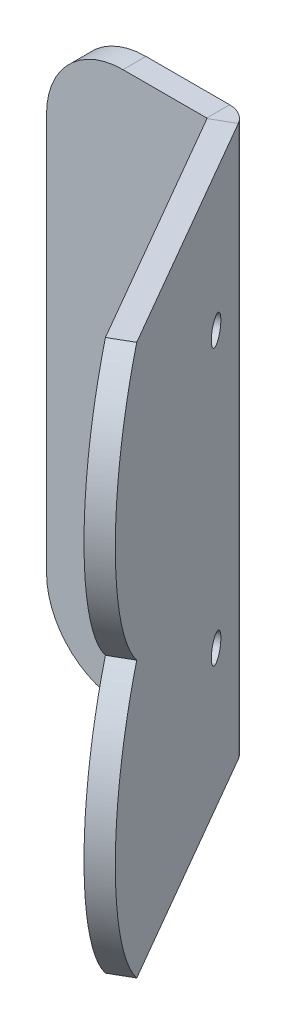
ISO-10303-21;
HEADER;
FILE_DESCRIPTION(('STEP AP214'),'2;1');
FILE_NAME('part.step','',(''),(''),'','','');
FILE_SCHEMA(('AUTOMOTIVE_DESIGN { 1 0 10303 214 1 1 1 1 }'));
ENDSEC;
DATA;
#1=APPLICATION_CONTEXT('core data for automotive mechanical design processes');
#2=APPLICATION_PROTOCOL_DEFINITION('international standard','automotive_design',2000,#1);
#3=PRODUCT_CONTEXT('',#1,'mechanical');
#4=PRODUCT('Part','Part','',(#3));
#5=PRODUCT_RELATED_PRODUCT_CATEGORY('part','',(#4));
#6=PRODUCT_DEFINITION_FORMATION('','',#4);
#7=PRODUCT_DEFINITION_CONTEXT('part definition',#1,'design');
#8=PRODUCT_DEFINITION('design','',#6,#7);
#9=PRODUCT_DEFINITION_SHAPE('','',#8);
#10=(LENGTH_UNIT() NAMED_UNIT(*) SI_UNIT(.MILLI.,.METRE.));
#11=(NAMED_UNIT(*) PLANE_ANGLE_UNIT() SI_UNIT($,.RADIAN.));
#12=(NAMED_UNIT(*) SI_UNIT($,.STERADIAN.) SOLID_ANGLE_UNIT());
#13=UNCERTAINTY_MEASURE_WITH_UNIT(LENGTH_MEASURE(1.E-05),#10,'distance_accuracy_value','');
#14=(GEOMETRIC_REPRESENTATION_CONTEXT(3) GLOBAL_UNCERTAINTY_ASSIGNED_CONTEXT((#13)) GLOBAL_UNIT_ASSIGNED_CONTEXT((#10,
#11,#12)) REPRESENTATION_CONTEXT('',''));
#15=CARTESIAN_POINT('',(0.,0.,0.));
#16=DIRECTION('',(0.,0.,1.));
#17=DIRECTION('',(1.,0.,0.));
#18=AXIS2_PLACEMENT_3D('',#15,#16,#17);
#19=CARTESIAN_POINT('',(33.1061153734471,18.,17.9591240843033));
#20=DIRECTION('',(-0.86602540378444,0.,0.499999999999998));
#21=DIRECTION('',(0.499999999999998,0.,0.86602540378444));
#22=AXIS2_PLACEMENT_3D('',#19,#20,#21);
#23=PLANE('',#22);
#24=CARTESIAN_POINT('',(27.6061153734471,18.,8.43284464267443));
#25=DIRECTION('',(-0.86602540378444,0.,0.499999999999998));
#26=DIRECTION('',(0.499999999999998,0.,0.86602540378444));
#27=AXIS2_PLACEMENT_3D('',#24,#25,#26);
#28=CIRCLE('',#27,1.7);
#29=CARTESIAN_POINT('',(28.4561153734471,18.,9.90508782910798));
#30=VERTEX_POINT('',#29);
#31=EDGE_CURVE('E221',#30,#30,#28,.T.);
#32=ORIENTED_EDGE('',*,*,#31,.T.);
#33=EDGE_LOOP('',(#32));
#34=FACE_BOUND('',#33,.T.);
#35=CARTESIAN_POINT('',(27.6061153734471,54.,8.43284464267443));
#36=DIRECTION('',(-0.86602540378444,0.,0.499999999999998));
#37=DIRECTION('',(0.499999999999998,0.,0.86602540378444));
#38=AXIS2_PLACEMENT_3D('',#35,#36,#37);
#39=CIRCLE('',#38,1.7);
#40=CARTESIAN_POINT('',(28.4561153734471,54.,9.90508782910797));
#41=VERTEX_POINT('',#40);
#42=EDGE_CURVE('E212',#41,#41,#39,.T.);
#43=ORIENTED_EDGE('',*,*,#42,.T.);
#44=EDGE_LOOP('',(#43));
#45=FACE_BOUND('',#44,.T.);
#46=DIRECTION('',(0.499999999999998,0.,0.86602540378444));
#47=VECTOR('',#46,1.);
#48=CARTESIAN_POINT('',(18.1061153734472,0.,-8.02163802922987));
#49=LINE('',#48,#47);
#50=CARTESIAN_POINT('',(23.6323031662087,0.,1.55));
#51=VERTEX_POINT('',#50);
#52=CARTESIAN_POINT('',(41.7807911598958,0.,32.98410328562));
#53=VERTEX_POINT('',#52);
#54=EDGE_CURVE('E64',#51,#53,#49,.T.);
#55=ORIENTED_EDGE('',*,*,#54,.F.);
#56=DIRECTION('',(0.,1.,0.));
#57=VECTOR('',#56,1.);
#58=CARTESIAN_POINT('',(23.6323031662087,18.,1.55));
#59=LINE('',#58,#57);
#60=CARTESIAN_POINT('',(23.6323031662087,72.,1.55000000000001));
#61=VERTEX_POINT('',#60);
#62=EDGE_CURVE('E56',#51,#61,#59,.T.);
#63=ORIENTED_EDGE('',*,*,#62,.T.);
#64=DIRECTION('',(-0.499999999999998,0.,-0.86602540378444));
#65=VECTOR('',#64,1.);
#66=CARTESIAN_POINT('',(18.1061153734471,72.,-8.02163802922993));
#67=LINE('',#66,#65);
#68=CARTESIAN_POINT('',(41.7807911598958,72.,32.98410328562));
#69=VERTEX_POINT('',#68);
#70=EDGE_CURVE('E71',#69,#61,#67,.T.);
#71=ORIENTED_EDGE('',*,*,#70,.F.);
#72=CARTESIAN_POINT('',(33.1061153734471,54.,17.9591240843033));
#73=DIRECTION('',(-0.86602540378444,0.,0.499999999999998));
#74=DIRECTION('',(0.499999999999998,0.,0.86602540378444));
#75=AXIS2_PLACEMENT_3D('',#72,#73,#74);
#76=CIRCLE('',#75,25.);
#77=CARTESIAN_POINT('',(41.7807911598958,36.,32.98410328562));
#78=VERTEX_POINT('',#77);
#79=EDGE_CURVE('E233',#78,#69,#76,.T.);
#80=ORIENTED_EDGE('',*,*,#79,.F.);
#81=CARTESIAN_POINT('',(33.1061153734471,18.,17.9591240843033));
#82=DIRECTION('',(-0.86602540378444,0.,0.499999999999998));
#83=DIRECTION('',(0.499999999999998,0.,0.86602540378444));
#84=AXIS2_PLACEMENT_3D('',#81,#82,#83);
#85=CIRCLE('',#84,25.);
#86=EDGE_CURVE('E224',#53,#78,#85,.T.);
#87=ORIENTED_EDGE('',*,*,#86,.F.);
#88=EDGE_LOOP('',(#55,#63,#71,#80,#87));
#89=FACE_BOUND('',#88,.T.);
#90=ADVANCED_FACE('F47',(#34,#45,#89),#23,.F.);
#91=CARTESIAN_POINT('',(15.5080391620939,0.,-6.52163802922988));
#92=DIRECTION('',(0.,1.,0.));
#93=DIRECTION('',(-0.86602540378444,0.,0.499999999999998));
#94=AXIS2_PLACEMENT_3D('',#91,#92,#93);
#95=PLANE('',#94);
#96=DIRECTION('',(0.499999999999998,0.,0.86602540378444));
#97=VECTOR('',#96,1.);
#98=CARTESIAN_POINT('',(15.5080391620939,0.,-6.52163802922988));
#99=LINE('',#98,#97);
#100=CARTESIAN_POINT('',(21.0342269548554,0.,3.04999999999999));
#101=VERTEX_POINT('',#100);
#102=CARTESIAN_POINT('',(39.1827149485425,0.,34.48410328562));
#103=VERTEX_POINT('',#102);
#104=EDGE_CURVE('E51',#101,#103,#99,.T.);
#105=ORIENTED_EDGE('',*,*,#104,.F.);
#106=DIRECTION('',(0.86602540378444,0.,-0.499999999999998));
#107=VECTOR('',#106,1.);
#108=CARTESIAN_POINT('',(21.0342269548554,0.,3.05));
#109=LINE('',#108,#107);
#110=EDGE_CURVE('E14',#101,#51,#109,.T.);
#111=ORIENTED_EDGE('',*,*,#110,.T.);
#112=ORIENTED_EDGE('',*,*,#54,.T.);
#113=DIRECTION('',(0.86602540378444,0.,-0.499999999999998));
#114=VECTOR('',#113,1.);
#115=CARTESIAN_POINT('',(39.1827149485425,0.,34.48410328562));
#116=LINE('',#115,#114);
#117=EDGE_CURVE('E235',#103,#53,#116,.T.);
#118=ORIENTED_EDGE('',*,*,#117,.F.);
#119=EDGE_LOOP('',(#105,#111,#112,#118));
#120=FACE_BOUND('',#119,.T.);
#121=ADVANCED_FACE('F49',(#120),#95,.F.);
#122=CARTESIAN_POINT('',(15.5080391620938,72.,-6.52163802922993));
#123=DIRECTION('',(0.,-1.,0.));
#124=DIRECTION('',(0.86602540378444,0.,-0.499999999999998));
#125=AXIS2_PLACEMENT_3D('',#122,#123,#124);
#126=PLANE('',#125);
#127=ORIENTED_EDGE('',*,*,#70,.T.);
#128=DIRECTION('',(-0.86602540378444,0.,0.499999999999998));
#129=VECTOR('',#128,1.);
#130=CARTESIAN_POINT('',(21.0342269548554,72.,3.05));
#131=LINE('',#130,#129);
#132=CARTESIAN_POINT('',(21.0342269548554,72.,3.05000000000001));
#133=VERTEX_POINT('',#132);
#134=EDGE_CURVE('E244',#61,#133,#131,.T.);
#135=ORIENTED_EDGE('',*,*,#134,.T.);
#136=DIRECTION('',(-0.499999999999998,0.,-0.86602540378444));
#137=VECTOR('',#136,1.);
#138=CARTESIAN_POINT('',(15.5080391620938,72.,-6.52163802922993));
#139=LINE('',#138,#137);
#140=CARTESIAN_POINT('',(39.1827149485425,72.,34.48410328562));
#141=VERTEX_POINT('',#140);
#142=EDGE_CURVE('E230',#141,#133,#139,.T.);
#143=ORIENTED_EDGE('',*,*,#142,.F.);
#144=DIRECTION('',(0.86602540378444,0.,-0.499999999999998));
#145=VECTOR('',#144,1.);
#146=CARTESIAN_POINT('',(39.1827149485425,72.,34.48410328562));
#147=LINE('',#146,#145);
#148=EDGE_CURVE('E238',#141,#69,#147,.T.);
#149=ORIENTED_EDGE('',*,*,#148,.T.);
#150=EDGE_LOOP('',(#127,#135,#143,#149));
#151=FACE_BOUND('',#150,.T.);
#152=ADVANCED_FACE('F264',(#151),#126,.F.);
#153=CARTESIAN_POINT('',(30.5080391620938,18.,19.4591240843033));
#154=DIRECTION('',(0.86602540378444,0.,-0.499999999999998));
#155=DIRECTION('',(-0.499999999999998,0.,-0.86602540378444));
#156=AXIS2_PLACEMENT_3D('',#153,#154,#155);
#157=CYLINDRICAL_SURFACE('',#156,25.);
#158=ORIENTED_EDGE('',*,*,#86,.T.);
#159=DIRECTION('',(0.86602540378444,0.,-0.499999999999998));
#160=VECTOR('',#159,1.);
#161=CARTESIAN_POINT('',(39.1827149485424,36.,34.48410328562));
#162=LINE('',#161,#160);
#163=CARTESIAN_POINT('',(39.1827149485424,36.,34.48410328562));
#164=VERTEX_POINT('',#163);
#165=EDGE_CURVE('E240',#164,#78,#162,.T.);
#166=ORIENTED_EDGE('',*,*,#165,.F.);
#167=CARTESIAN_POINT('',(30.5080391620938,18.,19.4591240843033));
#168=DIRECTION('',(-0.86602540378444,0.,0.499999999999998));
#169=DIRECTION('',(0.499999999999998,0.,0.86602540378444));
#170=AXIS2_PLACEMENT_3D('',#167,#168,#169);
#171=CIRCLE('',#170,25.);
#172=EDGE_CURVE('E225',#103,#164,#171,.T.);
#173=ORIENTED_EDGE('',*,*,#172,.F.);
#174=ORIENTED_EDGE('',*,*,#117,.T.);
#175=EDGE_LOOP('',(#158,#166,#173,#174));
#176=FACE_BOUND('',#175,.T.);
#177=ADVANCED_FACE('F260',(#176),#157,.T.);
#178=CARTESIAN_POINT('',(30.5080391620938,54.,19.4591240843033));
#179=DIRECTION('',(0.86602540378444,0.,-0.499999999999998));
#180=DIRECTION('',(-0.499999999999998,0.,-0.86602540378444));
#181=AXIS2_PLACEMENT_3D('',#178,#179,#180);
#182=CYLINDRICAL_SURFACE('',#181,25.);
#183=ORIENTED_EDGE('',*,*,#79,.T.);
#184=ORIENTED_EDGE('',*,*,#148,.F.);
#185=CARTESIAN_POINT('',(30.5080391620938,54.,19.4591240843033));
#186=DIRECTION('',(-0.86602540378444,0.,0.499999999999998));
#187=DIRECTION('',(0.499999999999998,0.,0.86602540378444));
#188=AXIS2_PLACEMENT_3D('',#185,#186,#187);
#189=CIRCLE('',#188,25.);
#190=EDGE_CURVE('E228',#164,#141,#189,.T.);
#191=ORIENTED_EDGE('',*,*,#190,.F.);
#192=ORIENTED_EDGE('',*,*,#165,.T.);
#193=EDGE_LOOP('',(#183,#184,#191,#192));
#194=FACE_BOUND('',#193,.T.);
#195=ADVANCED_FACE('F262',(#194),#182,.T.);
#196=CARTESIAN_POINT('',(30.5080391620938,18.,19.4591240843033));
#197=DIRECTION('',(-0.86602540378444,0.,0.499999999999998));
#198=DIRECTION('',(0.499999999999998,0.,0.86602540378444));
#199=AXIS2_PLACEMENT_3D('',#196,#197,#198);
#200=PLANE('',#199);
#201=DIRECTION('',(0.,1.,0.));
#202=VECTOR('',#201,1.);
#203=CARTESIAN_POINT('',(21.0342269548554,18.,3.05));
#204=LINE('',#203,#202);
#205=EDGE_CURVE('E168',#101,#133,#204,.T.);
#206=ORIENTED_EDGE('',*,*,#205,.F.);
#207=ORIENTED_EDGE('',*,*,#104,.T.);
#208=ORIENTED_EDGE('',*,*,#172,.T.);
#209=ORIENTED_EDGE('',*,*,#190,.T.);
#210=ORIENTED_EDGE('',*,*,#142,.T.);
#211=EDGE_LOOP('',(#206,#207,#208,#209,#210));
#212=FACE_BOUND('',#211,.T.);
#213=CARTESIAN_POINT('',(25.0080391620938,54.,9.93284464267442));
#214=DIRECTION('',(-0.86602540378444,0.,0.499999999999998));
#215=DIRECTION('',(0.499999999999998,0.,0.86602540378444));
#216=AXIS2_PLACEMENT_3D('',#213,#214,#215);
#217=CIRCLE('',#216,3.15);
#218=CARTESIAN_POINT('',(26.5830391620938,54.,12.6608246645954));
#219=VERTEX_POINT('',#218);
#220=EDGE_CURVE('E182',#219,#219,#217,.T.);
#221=ORIENTED_EDGE('',*,*,#220,.F.);
#222=EDGE_LOOP('',(#221));
#223=FACE_BOUND('',#222,.T.);
#224=CARTESIAN_POINT('',(25.0080391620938,18.,9.93284464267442));
#225=DIRECTION('',(-0.86602540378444,0.,0.499999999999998));
#226=DIRECTION('',(0.499999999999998,0.,0.86602540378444));
#227=AXIS2_PLACEMENT_3D('',#224,#225,#226);
#228=CIRCLE('',#227,3.15);
#229=CARTESIAN_POINT('',(26.5830391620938,18.,12.6608246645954));
#230=VERTEX_POINT('',#229);
#231=EDGE_CURVE('E215',#230,#230,#228,.T.);
#232=ORIENTED_EDGE('',*,*,#231,.F.);
#233=EDGE_LOOP('',(#232));
#234=FACE_BOUND('',#233,.T.);
#235=ADVANCED_FACE('F253',(#212,#223,#234),#200,.T.);
#236=CARTESIAN_POINT('',(25.0080391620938,18.,9.93284464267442));
#237=DIRECTION('',(-0.86602540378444,0.,0.499999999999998));
#238=DIRECTION('',(0.499999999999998,0.,0.86602540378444));
#239=AXIS2_PLACEMENT_3D('',#236,#237,#238);
#240=CYLINDRICAL_SURFACE('',#239,1.7);
#241=ORIENTED_EDGE('',*,*,#31,.F.);
#242=EDGE_LOOP('',(#241));
#243=FACE_BOUND('',#242,.T.);
#244=CARTESIAN_POINT('',(26.2637759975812,18.,9.20784464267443));
#245=DIRECTION('',(-0.86602540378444,0.,0.499999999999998));
#246=DIRECTION('',(0.499999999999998,0.,0.86602540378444));
#247=AXIS2_PLACEMENT_3D('',#244,#245,#246);
#248=CIRCLE('',#247,1.7);
#249=CARTESIAN_POINT('',(27.1137759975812,18.,10.680087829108));
#250=VERTEX_POINT('',#249);
#251=EDGE_CURVE('E218',#250,#250,#248,.T.);
#252=ORIENTED_EDGE('',*,*,#251,.T.);
#253=EDGE_LOOP('',(#252));
#254=FACE_BOUND('',#253,.T.);
#255=ADVANCED_FACE('F310',(#243,#254),#240,.F.);
#256=CARTESIAN_POINT('',(25.0080391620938,18.,9.93284464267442));
#257=DIRECTION('',(-0.86602540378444,0.,0.499999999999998));
#258=DIRECTION('',(0.499999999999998,0.,0.86602540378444));
#259=AXIS2_PLACEMENT_3D('',#256,#257,#258);
#260=CONICAL_SURFACE('',#259,3.15,0.785398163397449);
#261=ORIENTED_EDGE('',*,*,#251,.F.);
#262=EDGE_LOOP('',(#261));
#263=FACE_BOUND('',#262,.T.);
#264=ORIENTED_EDGE('',*,*,#231,.T.);
#265=EDGE_LOOP('',(#264));
#266=FACE_BOUND('',#265,.T.);
#267=ADVANCED_FACE('F317',(#263,#266),#260,.F.);
#268=CARTESIAN_POINT('',(25.0080391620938,54.,9.93284464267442));
#269=DIRECTION('',(-0.86602540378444,0.,0.499999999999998));
#270=DIRECTION('',(0.499999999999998,0.,0.86602540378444));
#271=AXIS2_PLACEMENT_3D('',#268,#269,#270);
#272=CYLINDRICAL_SURFACE('',#271,1.7);
#273=ORIENTED_EDGE('',*,*,#42,.F.);
#274=EDGE_LOOP('',(#273));
#275=FACE_BOUND('',#274,.T.);
#276=CARTESIAN_POINT('',(26.2637759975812,54.,9.20784464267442));
#277=DIRECTION('',(-0.86602540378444,0.,0.499999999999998));
#278=DIRECTION('',(0.499999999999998,0.,0.86602540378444));
#279=AXIS2_PLACEMENT_3D('',#276,#277,#278);
#280=CIRCLE('',#279,1.7);
#281=CARTESIAN_POINT('',(27.1137759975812,54.,10.680087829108));
#282=VERTEX_POINT('',#281);
#283=EDGE_CURVE('E209',#282,#282,#280,.T.);
#284=ORIENTED_EDGE('',*,*,#283,.T.);
#285=EDGE_LOOP('',(#284));
#286=FACE_BOUND('',#285,.T.);
#287=ADVANCED_FACE('F321',(#275,#286),#272,.F.);
#288=CARTESIAN_POINT('',(25.0080391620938,54.,9.93284464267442));
#289=DIRECTION('',(-0.86602540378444,0.,0.499999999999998));
#290=DIRECTION('',(0.499999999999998,0.,0.86602540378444));
#291=AXIS2_PLACEMENT_3D('',#288,#289,#290);
#292=CONICAL_SURFACE('',#291,3.15,0.785398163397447);
#293=ORIENTED_EDGE('',*,*,#283,.F.);
#294=EDGE_LOOP('',(#293));
#295=FACE_BOUND('',#294,.T.);
#296=ORIENTED_EDGE('',*,*,#220,.T.);
#297=EDGE_LOOP('',(#296));
#298=FACE_BOUND('',#297,.T.);
#299=ADVANCED_FACE('F325',(#295,#298),#292,.F.);
#300=CARTESIAN_POINT('',(10.,10.,3.));
#301=DIRECTION('',(0.,0.,-1.));
#302=DIRECTION('',(-1.,0.,0.));
#303=AXIS2_PLACEMENT_3D('',#300,#301,#302);
#304=CYLINDRICAL_SURFACE('',#303,10.);
#305=CARTESIAN_POINT('',(10.,10.,0.));
#306=DIRECTION('',(0.,0.,1.));
#307=DIRECTION('',(-1.,0.,0.));
#308=AXIS2_PLACEMENT_3D('',#305,#306,#307);
#309=CIRCLE('',#308,10.);
#310=CARTESIAN_POINT('',(0.,10.0000000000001,0.));
#311=VERTEX_POINT('',#310);
#312=CARTESIAN_POINT('',(10.0000000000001,0.,0.));
#313=VERTEX_POINT('',#312);
#314=EDGE_CURVE('E163',#311,#313,#309,.T.);
#315=ORIENTED_EDGE('',*,*,#314,.T.);
#316=DIRECTION('',(0.,0.,-1.));
#317=VECTOR('',#316,1.);
#318=CARTESIAN_POINT('',(10.0000000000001,0.,3.));
#319=LINE('',#318,#317);
#320=CARTESIAN_POINT('',(10.0000000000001,0.,3.));
#321=VERTEX_POINT('',#320);
#322=EDGE_CURVE('E183',#321,#313,#319,.T.);
#323=ORIENTED_EDGE('',*,*,#322,.F.);
#324=CARTESIAN_POINT('',(10.,10.,3.));
#325=DIRECTION('',(0.,0.,1.));
#326=DIRECTION('',(-1.,0.,0.));
#327=AXIS2_PLACEMENT_3D('',#324,#325,#326);
#328=CIRCLE('',#327,10.);
#329=CARTESIAN_POINT('',(0.,10.0000000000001,3.));
#330=VERTEX_POINT('',#329);
#331=EDGE_CURVE('E188',#330,#321,#328,.T.);
#332=ORIENTED_EDGE('',*,*,#331,.F.);
#333=DIRECTION('',(0.,0.,-1.));
#334=VECTOR('',#333,1.);
#335=CARTESIAN_POINT('',(0.,10.0000000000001,3.));
#336=LINE('',#335,#334);
#337=EDGE_CURVE('E202',#330,#311,#336,.T.);
#338=ORIENTED_EDGE('',*,*,#337,.T.);
#339=EDGE_LOOP('',(#315,#323,#332,#338));
#340=FACE_BOUND('',#339,.T.);
#341=ADVANCED_FACE('F282',(#340),#304,.T.);
#342=CARTESIAN_POINT('',(0.,10.0000000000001,3.));
#343=DIRECTION('',(1.,0.,0.));
#344=DIRECTION('',(0.,0.,-1.));
#345=AXIS2_PLACEMENT_3D('',#342,#343,#344);
#346=PLANE('',#345);
#347=DIRECTION('',(0.,-1.,0.));
#348=VECTOR('',#347,1.);
#349=CARTESIAN_POINT('',(0.,10.0000000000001,0.));
#350=LINE('',#349,#348);
#351=CARTESIAN_POINT('',(0.,62.,0.));
#352=VERTEX_POINT('',#351);
#353=EDGE_CURVE('E200',#352,#311,#350,.T.);
#354=ORIENTED_EDGE('',*,*,#353,.T.);
#355=ORIENTED_EDGE('',*,*,#337,.F.);
#356=DIRECTION('',(0.,-1.,0.));
#357=VECTOR('',#356,1.);
#358=CARTESIAN_POINT('',(0.,10.0000000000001,3.));
#359=LINE('',#358,#357);
#360=CARTESIAN_POINT('',(0.,62.,3.));
#361=VERTEX_POINT('',#360);
#362=EDGE_CURVE('E190',#361,#330,#359,.T.);
#363=ORIENTED_EDGE('',*,*,#362,.F.);
#364=DIRECTION('',(0.,0.,-1.));
#365=VECTOR('',#364,1.);
#366=CARTESIAN_POINT('',(0.,62.,3.));
#367=LINE('',#366,#365);
#368=EDGE_CURVE('E197',#361,#352,#367,.T.);
#369=ORIENTED_EDGE('',*,*,#368,.T.);
#370=EDGE_LOOP('',(#354,#355,#363,#369));
#371=FACE_BOUND('',#370,.T.);
#372=ADVANCED_FACE('F286',(#371),#346,.F.);
#373=CARTESIAN_POINT('',(10.,62.,3.));
#374=DIRECTION('',(0.,0.,-1.));
#375=DIRECTION('',(-1.,0.,0.));
#376=AXIS2_PLACEMENT_3D('',#373,#374,#375);
#377=CYLINDRICAL_SURFACE('',#376,10.);
#378=CARTESIAN_POINT('',(10.,62.,0.));
#379=DIRECTION('',(0.,0.,1.));
#380=DIRECTION('',(-1.,0.,0.));
#381=AXIS2_PLACEMENT_3D('',#378,#379,#380);
#382=CIRCLE('',#381,10.);
#383=CARTESIAN_POINT('',(10.,72.,0.));
#384=VERTEX_POINT('',#383);
#385=EDGE_CURVE('E195',#384,#352,#382,.T.);
#386=ORIENTED_EDGE('',*,*,#385,.T.);
#387=ORIENTED_EDGE('',*,*,#368,.F.);
#388=CARTESIAN_POINT('',(10.,62.,3.));
#389=DIRECTION('',(0.,0.,1.));
#390=DIRECTION('',(-1.,0.,0.));
#391=AXIS2_PLACEMENT_3D('',#388,#389,#390);
#392=CIRCLE('',#391,10.);
#393=CARTESIAN_POINT('',(10.,72.,3.));
#394=VERTEX_POINT('',#393);
#395=EDGE_CURVE('E142',#394,#361,#392,.T.);
#396=ORIENTED_EDGE('',*,*,#395,.F.);
#397=DIRECTION('',(0.,0.,-1.));
#398=VECTOR('',#397,1.);
#399=CARTESIAN_POINT('',(10.,72.,3.));
#400=LINE('',#399,#398);
#401=EDGE_CURVE('E139',#394,#384,#400,.T.);
#402=ORIENTED_EDGE('',*,*,#401,.T.);
#403=EDGE_LOOP('',(#386,#387,#396,#402));
#404=FACE_BOUND('',#403,.T.);
#405=ADVANCED_FACE('F290',(#404),#377,.T.);
#406=CARTESIAN_POINT('',(40.,18.,3.));
#407=DIRECTION('',(0.,0.,1.));
#408=DIRECTION('',(1.,0.,0.));
#409=AXIS2_PLACEMENT_3D('',#406,#407,#408);
#410=PLANE('',#409);
#411=DIRECTION('',(1.,0.,0.));
#412=VECTOR('',#411,1.);
#413=CARTESIAN_POINT('',(10.0000000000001,0.,3.));
#414=LINE('',#413,#412);
#415=CARTESIAN_POINT('',(20.9476244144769,0.,3.));
#416=VERTEX_POINT('',#415);
#417=EDGE_CURVE('E148',#321,#416,#414,.T.);
#418=ORIENTED_EDGE('',*,*,#417,.T.);
#419=DIRECTION('',(0.,1.,0.));
#420=VECTOR('',#419,1.);
#421=CARTESIAN_POINT('',(20.9476244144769,18.,3.));
#422=LINE('',#421,#420);
#423=CARTESIAN_POINT('',(20.9476244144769,72.,3.));
#424=VERTEX_POINT('',#423);
#425=EDGE_CURVE('E143',#416,#424,#422,.T.);
#426=ORIENTED_EDGE('',*,*,#425,.T.);
#427=DIRECTION('',(-1.,0.,0.));
#428=VECTOR('',#427,1.);
#429=CARTESIAN_POINT('',(10.,72.,3.));
#430=LINE('',#429,#428);
#431=EDGE_CURVE('E132',#424,#394,#430,.T.);
#432=ORIENTED_EDGE('',*,*,#431,.T.);
#433=ORIENTED_EDGE('',*,*,#395,.T.);
#434=ORIENTED_EDGE('',*,*,#362,.T.);
#435=ORIENTED_EDGE('',*,*,#331,.T.);
#436=EDGE_LOOP('',(#418,#426,#432,#433,#434,#435));
#437=FACE_BOUND('',#436,.T.);
#438=ADVANCED_FACE('F146',(#437),#410,.T.);
#439=CARTESIAN_POINT('',(10.,72.,3.));
#440=DIRECTION('',(0.,-1.,0.));
#441=DIRECTION('',(0.,0.,-1.));
#442=AXIS2_PLACEMENT_3D('',#439,#440,#441);
#443=PLANE('',#442);
#444=DIRECTION('',(0.,0.,1.));
#445=VECTOR('',#444,1.);
#446=CARTESIAN_POINT('',(20.9476244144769,72.,3.));
#447=LINE('',#446,#445);
#448=CARTESIAN_POINT('',(20.9476244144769,72.,0.));
#449=VERTEX_POINT('',#448);
#450=EDGE_CURVE('E136',#449,#424,#447,.T.);
#451=ORIENTED_EDGE('',*,*,#450,.F.);
#452=DIRECTION('',(-1.,0.,0.));
#453=VECTOR('',#452,1.);
#454=CARTESIAN_POINT('',(10.,72.,0.));
#455=LINE('',#454,#453);
#456=EDGE_CURVE('E186',#449,#384,#455,.T.);
#457=ORIENTED_EDGE('',*,*,#456,.T.);
#458=ORIENTED_EDGE('',*,*,#401,.F.);
#459=ORIENTED_EDGE('',*,*,#431,.F.);
#460=EDGE_LOOP('',(#451,#457,#458,#459));
#461=FACE_BOUND('',#460,.T.);
#462=ADVANCED_FACE('F134',(#461),#443,.F.);
#463=CARTESIAN_POINT('',(40.,18.,0.));
#464=DIRECTION('',(0.,0.,1.));
#465=DIRECTION('',(1.,0.,0.));
#466=AXIS2_PLACEMENT_3D('',#463,#464,#465);
#467=PLANE('',#466);
#468=DIRECTION('',(0.,1.,0.));
#469=VECTOR('',#468,1.);
#470=CARTESIAN_POINT('',(20.9476244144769,18.,0.));
#471=LINE('',#470,#469);
#472=CARTESIAN_POINT('',(20.9476244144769,0.,0.));
#473=VERTEX_POINT('',#472);
#474=EDGE_CURVE('E164',#473,#449,#471,.T.);
#475=ORIENTED_EDGE('',*,*,#474,.F.);
#476=DIRECTION('',(1.,0.,0.));
#477=VECTOR('',#476,1.);
#478=CARTESIAN_POINT('',(10.0000000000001,0.,0.));
#479=LINE('',#478,#477);
#480=EDGE_CURVE('E180',#313,#473,#479,.T.);
#481=ORIENTED_EDGE('',*,*,#480,.F.);
#482=ORIENTED_EDGE('',*,*,#314,.F.);
#483=ORIENTED_EDGE('',*,*,#353,.F.);
#484=ORIENTED_EDGE('',*,*,#385,.F.);
#485=ORIENTED_EDGE('',*,*,#456,.F.);
#486=EDGE_LOOP('',(#475,#481,#482,#483,#484,#485));
#487=FACE_BOUND('',#486,.T.);
#488=ADVANCED_FACE('F272',(#487),#467,.F.);
#489=CARTESIAN_POINT('',(10.0000000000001,0.,3.));
#490=DIRECTION('',(0.,1.,0.));
#491=DIRECTION('',(0.,0.,1.));
#492=AXIS2_PLACEMENT_3D('',#489,#490,#491);
#493=PLANE('',#492);
#494=DIRECTION('',(0.,0.,-1.));
#495=VECTOR('',#494,1.);
#496=CARTESIAN_POINT('',(20.9476244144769,0.,3.));
#497=LINE('',#496,#495);
#498=EDGE_CURVE('E169',#416,#473,#497,.T.);
#499=ORIENTED_EDGE('',*,*,#498,.F.);
#500=ORIENTED_EDGE('',*,*,#417,.F.);
#501=ORIENTED_EDGE('',*,*,#322,.T.);
#502=ORIENTED_EDGE('',*,*,#480,.T.);
#503=EDGE_LOOP('',(#499,#500,#501,#502));
#504=FACE_BOUND('',#503,.T.);
#505=ADVANCED_FACE('F278',(#504),#493,.F.);
#506=CARTESIAN_POINT('',(20.9476244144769,0.,3.1));
#507=DIRECTION('',(0.,1.,0.));
#508=DIRECTION('',(-1.,0.,0.));
#509=AXIS2_PLACEMENT_3D('',#506,#507,#508);
#510=PLANE('',#509);
#511=ORIENTED_EDGE('',*,*,#498,.T.);
#512=CARTESIAN_POINT('',(20.9476244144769,0.,3.1));
#513=DIRECTION('',(0.,1.,0.));
#514=DIRECTION('',(-1.,0.,0.));
#515=AXIS2_PLACEMENT_3D('',#512,#513,#514);
#516=CIRCLE('',#515,3.1);
#517=EDGE_CURVE('E176',#473,#51,#516,.F.);
#518=ORIENTED_EDGE('',*,*,#517,.T.);
#519=ORIENTED_EDGE('',*,*,#110,.F.);
#520=CARTESIAN_POINT('',(20.9476244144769,0.,3.1));
#521=DIRECTION('',(0.,-1.,0.));
#522=DIRECTION('',(1.,0.,0.));
#523=AXIS2_PLACEMENT_3D('',#520,#521,#522);
#524=CIRCLE('',#523,0.1);
#525=EDGE_CURVE('E170',#416,#101,#524,.T.);
#526=ORIENTED_EDGE('',*,*,#525,.F.);
#527=EDGE_LOOP('',(#511,#518,#519,#526));
#528=FACE_BOUND('',#527,.T.);
#529=ADVANCED_FACE('F276',(#528),#510,.F.);
#530=CARTESIAN_POINT('',(20.9476244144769,72.,3.1));
#531=DIRECTION('',(0.,-1.,0.));
#532=DIRECTION('',(0.,0.,-1.));
#533=AXIS2_PLACEMENT_3D('',#530,#531,#532);
#534=PLANE('',#533);
#535=CARTESIAN_POINT('',(20.9476244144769,72.,3.1));
#536=DIRECTION('',(0.,1.,0.));
#537=DIRECTION('',(-1.,0.,0.));
#538=AXIS2_PLACEMENT_3D('',#535,#536,#537);
#539=CIRCLE('',#538,3.1);
#540=EDGE_CURVE('E162',#61,#449,#539,.T.);
#541=ORIENTED_EDGE('',*,*,#540,.T.);
#542=ORIENTED_EDGE('',*,*,#450,.T.);
#543=CARTESIAN_POINT('',(20.9476244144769,72.,3.1));
#544=DIRECTION('',(0.,1.,0.));
#545=DIRECTION('',(0.,0.,1.));
#546=AXIS2_PLACEMENT_3D('',#543,#544,#545);
#547=CIRCLE('',#546,0.1);
#548=EDGE_CURVE('E160',#133,#424,#547,.T.);
#549=ORIENTED_EDGE('',*,*,#548,.F.);
#550=ORIENTED_EDGE('',*,*,#134,.F.);
#551=EDGE_LOOP('',(#541,#542,#549,#550));
#552=FACE_BOUND('',#551,.T.);
#553=ADVANCED_FACE('F158',(#552),#534,.F.);
#554=CARTESIAN_POINT('',(20.9476244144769,-36.0625490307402,3.1));
#555=DIRECTION('',(0.,1.,0.));
#556=DIRECTION('',(-1.,0.,0.));
#557=AXIS2_PLACEMENT_3D('',#554,#555,#556);
#558=CYLINDRICAL_SURFACE('',#557,0.1);
#559=ORIENTED_EDGE('',*,*,#205,.T.);
#560=ORIENTED_EDGE('',*,*,#548,.T.);
#561=ORIENTED_EDGE('',*,*,#425,.F.);
#562=ORIENTED_EDGE('',*,*,#525,.T.);
#563=EDGE_LOOP('',(#559,#560,#561,#562));
#564=FACE_BOUND('',#563,.T.);
#565=ADVANCED_FACE('F167',(#564),#558,.F.);
#566=CARTESIAN_POINT('',(20.9476244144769,-36.0625490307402,3.1));
#567=DIRECTION('',(0.,1.,0.));
#568=DIRECTION('',(-1.,0.,0.));
#569=AXIS2_PLACEMENT_3D('',#566,#567,#568);
#570=CYLINDRICAL_SURFACE('',#569,3.1);
#571=ORIENTED_EDGE('',*,*,#62,.F.);
#572=ORIENTED_EDGE('',*,*,#517,.F.);
#573=ORIENTED_EDGE('',*,*,#474,.T.);
#574=ORIENTED_EDGE('',*,*,#540,.F.);
#575=EDGE_LOOP('',(#571,#572,#573,#574));
#576=FACE_BOUND('',#575,.T.);
#577=ADVANCED_FACE('F267',(#576),#570,.T.);
#578=CLOSED_SHELL('',(#90,#121,#152,#177,#195,#235,#255,#267,#287,#299,#341,#372,#405,#438,#462,
#488,#505,#529,#553,#565,#577));
#579=MANIFOLD_SOLID_BREP('B2',#578);
#580=ADVANCED_BREP_SHAPE_REPRESENTATION('',(#18,#579),#14);
#581=SHAPE_DEFINITION_REPRESENTATION(#9,#580);
ENDSEC;
END-ISO-10303-21;
